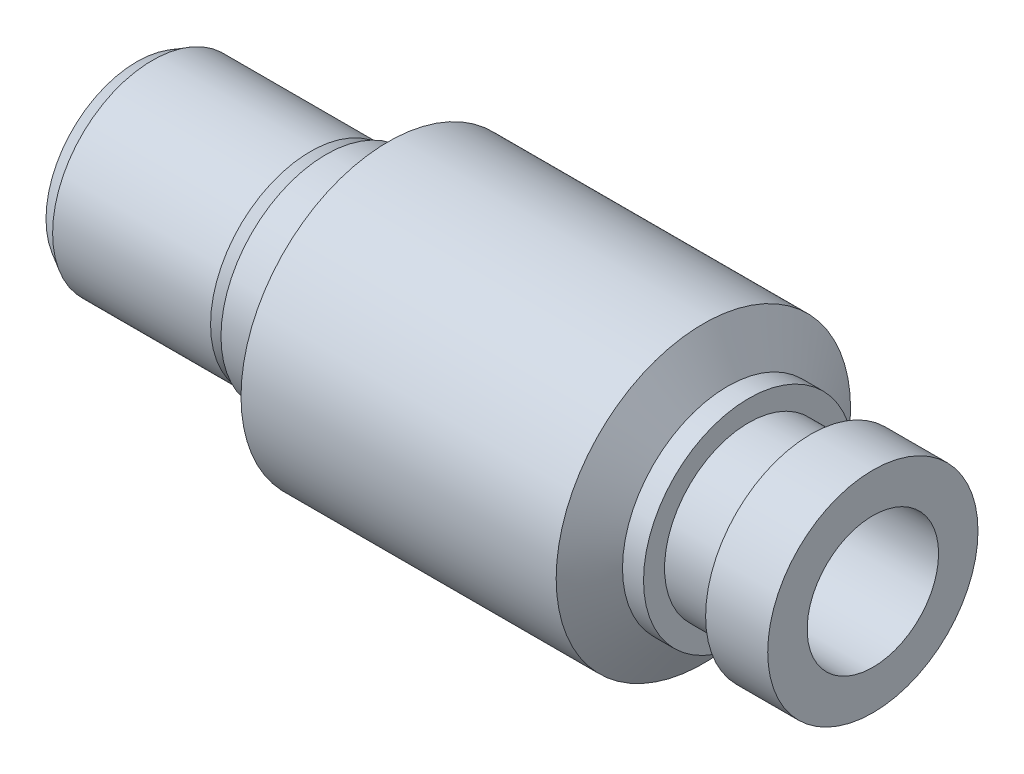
ISO-10303-21;
HEADER;
FILE_DESCRIPTION(('STEP AP214'),'2;1');
FILE_NAME('part.step','',(''),(''),'','','');
FILE_SCHEMA(('AUTOMOTIVE_DESIGN { 1 0 10303 214 1 1 1 1 }'));
ENDSEC;
DATA;
#1=APPLICATION_CONTEXT('core data for automotive mechanical design processes');
#2=APPLICATION_PROTOCOL_DEFINITION('international standard','automotive_design',2000,#1);
#3=PRODUCT_CONTEXT('',#1,'mechanical');
#4=PRODUCT('Part','Part','',(#3));
#5=PRODUCT_RELATED_PRODUCT_CATEGORY('part','',(#4));
#6=PRODUCT_DEFINITION_FORMATION('','',#4);
#7=PRODUCT_DEFINITION_CONTEXT('part definition',#1,'design');
#8=PRODUCT_DEFINITION('design','',#6,#7);
#9=PRODUCT_DEFINITION_SHAPE('','',#8);
#10=(LENGTH_UNIT() NAMED_UNIT(*) SI_UNIT(.MILLI.,.METRE.));
#11=(NAMED_UNIT(*) PLANE_ANGLE_UNIT() SI_UNIT($,.RADIAN.));
#12=(NAMED_UNIT(*) SI_UNIT($,.STERADIAN.) SOLID_ANGLE_UNIT());
#13=UNCERTAINTY_MEASURE_WITH_UNIT(LENGTH_MEASURE(1.E-05),#10,'distance_accuracy_value','');
#14=(GEOMETRIC_REPRESENTATION_CONTEXT(3) GLOBAL_UNCERTAINTY_ASSIGNED_CONTEXT((#13)) GLOBAL_UNIT_ASSIGNED_CONTEXT((#10,
#11,#12)) REPRESENTATION_CONTEXT('',''));
#15=CARTESIAN_POINT('',(0.,0.,0.));
#16=DIRECTION('',(0.,0.,1.));
#17=DIRECTION('',(1.,0.,0.));
#18=AXIS2_PLACEMENT_3D('',#15,#16,#17);
#19=CARTESIAN_POINT('',(0.,0.,0.));
#20=DIRECTION('',(-1.,0.,0.));
#21=DIRECTION('',(0.,0.,1.));
#22=AXIS2_PLACEMENT_3D('',#19,#20,#21);
#23=PLANE('',#22);
#24=CARTESIAN_POINT('',(0.,0.,0.));
#25=DIRECTION('',(1.,0.,0.));
#26=DIRECTION('',(0.,0.,-1.));
#27=AXIS2_PLACEMENT_3D('',#24,#25,#26);
#28=CIRCLE('',#27,2.19475835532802);
#29=CARTESIAN_POINT('',(0.,0.,-2.19475835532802));
#30=VERTEX_POINT('',#29);
#31=EDGE_CURVE('E136',#30,#30,#28,.T.);
#32=ORIENTED_EDGE('',*,*,#31,.F.);
#33=EDGE_LOOP('',(#32));
#34=FACE_BOUND('',#33,.T.);
#35=DIRECTION('',(0.,-0.866025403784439,0.5));
#36=VECTOR('',#35,1.);
#37=CARTESIAN_POINT('',(0.,1.016,0.58658787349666));
#38=LINE('',#37,#36);
#39=CARTESIAN_POINT('',(0.,1.016,0.58658787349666));
#40=VERTEX_POINT('',#39);
#41=CARTESIAN_POINT('',(0.,0.,1.17317574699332));
#42=VERTEX_POINT('',#41);
#43=EDGE_CURVE('E95',#40,#42,#38,.T.);
#44=ORIENTED_EDGE('',*,*,#43,.T.);
#45=DIRECTION('',(0.,-0.866025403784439,-0.5));
#46=VECTOR('',#45,1.);
#47=CARTESIAN_POINT('',(0.,0.,1.17317574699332));
#48=LINE('',#47,#46);
#49=CARTESIAN_POINT('',(0.,-1.016,0.58658787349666));
#50=VERTEX_POINT('',#49);
#51=EDGE_CURVE('E97',#42,#50,#48,.T.);
#52=ORIENTED_EDGE('',*,*,#51,.T.);
#53=DIRECTION('',(0.,0.,-1.));
#54=VECTOR('',#53,1.);
#55=CARTESIAN_POINT('',(0.,-1.016,0.58658787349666));
#56=LINE('',#55,#54);
#57=CARTESIAN_POINT('',(0.,-1.016,-0.58658787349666));
#58=VERTEX_POINT('',#57);
#59=EDGE_CURVE('E88',#50,#58,#56,.T.);
#60=ORIENTED_EDGE('',*,*,#59,.T.);
#61=DIRECTION('',(0.,0.866025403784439,-0.5));
#62=VECTOR('',#61,1.);
#63=CARTESIAN_POINT('',(0.,-1.016,-0.58658787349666));
#64=LINE('',#63,#62);
#65=CARTESIAN_POINT('',(0.,0.,-1.17317574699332));
#66=VERTEX_POINT('',#65);
#67=EDGE_CURVE('E32',#58,#66,#64,.T.);
#68=ORIENTED_EDGE('',*,*,#67,.T.);
#69=DIRECTION('',(0.,0.866025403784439,0.5));
#70=VECTOR('',#69,1.);
#71=CARTESIAN_POINT('',(0.,0.,-1.17317574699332));
#72=LINE('',#71,#70);
#73=CARTESIAN_POINT('',(0.,1.016,-0.58658787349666));
#74=VERTEX_POINT('',#73);
#75=EDGE_CURVE('E76',#66,#74,#72,.T.);
#76=ORIENTED_EDGE('',*,*,#75,.T.);
#77=DIRECTION('',(0.,0.,1.));
#78=VECTOR('',#77,1.);
#79=CARTESIAN_POINT('',(0.,1.016,-0.58658787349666));
#80=LINE('',#79,#78);
#81=EDGE_CURVE('E82',#74,#40,#80,.T.);
#82=ORIENTED_EDGE('',*,*,#81,.T.);
#83=EDGE_LOOP('',(#44,#52,#60,#68,#76,#82));
#84=FACE_BOUND('',#83,.T.);
#85=ADVANCED_FACE('F17',(#34,#84),#23,.T.);
#86=CARTESIAN_POINT('',(14.272,0.,0.));
#87=DIRECTION('',(-1.,0.,0.));
#88=DIRECTION('',(0.,0.,1.));
#89=AXIS2_PLACEMENT_3D('',#86,#87,#88);
#90=CONICAL_SURFACE('',#89,2.54,1.0471975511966);
#91=CARTESIAN_POINT('',(13.6854121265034,0.,0.));
#92=DIRECTION('',(1.,0.,0.));
#93=DIRECTION('',(0.,0.,-1.));
#94=AXIS2_PLACEMENT_3D('',#91,#92,#93);
#95=CIRCLE('',#94,3.556);
#96=CARTESIAN_POINT('',(13.6854121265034,0.,-3.556));
#97=VERTEX_POINT('',#96);
#98=EDGE_CURVE('E10',#97,#97,#95,.T.);
#99=ORIENTED_EDGE('',*,*,#98,.T.);
#100=EDGE_LOOP('',(#99));
#101=FACE_BOUND('',#100,.T.);
#102=CARTESIAN_POINT('',(14.272,0.,0.));
#103=DIRECTION('',(1.,0.,0.));
#104=DIRECTION('',(0.,0.,-1.));
#105=AXIS2_PLACEMENT_3D('',#102,#103,#104);
#106=CIRCLE('',#105,2.54);
#107=CARTESIAN_POINT('',(14.272,0.,-2.54));
#108=VERTEX_POINT('',#107);
#109=EDGE_CURVE('E111',#108,#108,#106,.T.);
#110=ORIENTED_EDGE('',*,*,#109,.F.);
#111=EDGE_LOOP('',(#110));
#112=FACE_BOUND('',#111,.T.);
#113=ADVANCED_FACE('F19',(#101,#112),#90,.T.);
#114=CARTESIAN_POINT('',(0.,0.,0.));
#115=DIRECTION('',(1.,0.,0.));
#116=DIRECTION('',(0.,0.,-1.));
#117=AXIS2_PLACEMENT_3D('',#114,#115,#116);
#118=CYLINDRICAL_SURFACE('',#117,3.556);
#119=CARTESIAN_POINT('',(6.072,0.,0.));
#120=DIRECTION('',(1.,0.,0.));
#121=DIRECTION('',(0.,0.,-1.));
#122=AXIS2_PLACEMENT_3D('',#119,#120,#121);
#123=CIRCLE('',#122,3.556);
#124=CARTESIAN_POINT('',(6.072,0.,-3.556));
#125=VERTEX_POINT('',#124);
#126=EDGE_CURVE('E25',#125,#125,#123,.T.);
#127=ORIENTED_EDGE('',*,*,#126,.T.);
#128=EDGE_LOOP('',(#127));
#129=FACE_BOUND('',#128,.T.);
#130=ORIENTED_EDGE('',*,*,#98,.F.);
#131=EDGE_LOOP('',(#130));
#132=FACE_BOUND('',#131,.T.);
#133=ADVANCED_FACE('F156',(#129,#132),#118,.T.);
#134=CARTESIAN_POINT('',(6.072,2.54,0.));
#135=DIRECTION('',(-1.,0.,0.));
#136=DIRECTION('',(0.,0.,1.));
#137=AXIS2_PLACEMENT_3D('',#134,#135,#136);
#138=PLANE('',#137);
#139=CARTESIAN_POINT('',(6.072,0.,0.));
#140=DIRECTION('',(1.,0.,0.));
#141=DIRECTION('',(0.,0.,-1.));
#142=AXIS2_PLACEMENT_3D('',#139,#140,#141);
#143=CIRCLE('',#142,2.54);
#144=CARTESIAN_POINT('',(6.072,0.,-2.54));
#145=VERTEX_POINT('',#144);
#146=EDGE_CURVE('E151',#145,#145,#143,.T.);
#147=ORIENTED_EDGE('',*,*,#146,.T.);
#148=EDGE_LOOP('',(#147));
#149=FACE_BOUND('',#148,.T.);
#150=ORIENTED_EDGE('',*,*,#126,.F.);
#151=EDGE_LOOP('',(#150));
#152=FACE_BOUND('',#151,.T.);
#153=ADVANCED_FACE('F159',(#149,#152),#138,.T.);
#154=CARTESIAN_POINT('',(0.,0.,0.));
#155=DIRECTION('',(1.,0.,0.));
#156=DIRECTION('',(0.,0.,-1.));
#157=AXIS2_PLACEMENT_3D('',#154,#155,#156);
#158=CYLINDRICAL_SURFACE('',#157,2.54);
#159=CARTESIAN_POINT('',(4.572,0.,0.));
#160=DIRECTION('',(1.,0.,0.));
#161=DIRECTION('',(0.,0.,-1.));
#162=AXIS2_PLACEMENT_3D('',#159,#160,#161);
#163=CIRCLE('',#162,2.54);
#164=CARTESIAN_POINT('',(4.572,0.,-2.54));
#165=VERTEX_POINT('',#164);
#166=EDGE_CURVE('E148',#165,#165,#163,.T.);
#167=ORIENTED_EDGE('',*,*,#166,.T.);
#168=EDGE_LOOP('',(#167));
#169=FACE_BOUND('',#168,.T.);
#170=ORIENTED_EDGE('',*,*,#146,.F.);
#171=EDGE_LOOP('',(#170));
#172=FACE_BOUND('',#171,.T.);
#173=ADVANCED_FACE('F161',(#169,#172),#158,.T.);
#174=CARTESIAN_POINT('',(4.572,2.19475835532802,0.));
#175=DIRECTION('',(-1.,0.,0.));
#176=DIRECTION('',(0.,0.,1.));
#177=AXIS2_PLACEMENT_3D('',#174,#175,#176);
#178=PLANE('',#177);
#179=CARTESIAN_POINT('',(4.572,0.,0.));
#180=DIRECTION('',(1.,0.,0.));
#181=DIRECTION('',(0.,0.,-1.));
#182=AXIS2_PLACEMENT_3D('',#179,#180,#181);
#183=CIRCLE('',#182,2.19475835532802);
#184=CARTESIAN_POINT('',(4.572,0.,-2.19475835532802));
#185=VERTEX_POINT('',#184);
#186=EDGE_CURVE('E145',#185,#185,#183,.T.);
#187=ORIENTED_EDGE('',*,*,#186,.T.);
#188=EDGE_LOOP('',(#187));
#189=FACE_BOUND('',#188,.T.);
#190=ORIENTED_EDGE('',*,*,#166,.F.);
#191=EDGE_LOOP('',(#190));
#192=FACE_BOUND('',#191,.T.);
#193=ADVANCED_FACE('F169',(#189,#192),#178,.T.);
#194=CARTESIAN_POINT('',(4.572,0.,0.));
#195=DIRECTION('',(-1.,0.,0.));
#196=DIRECTION('',(0.,0.,1.));
#197=AXIS2_PLACEMENT_3D('',#194,#195,#196);
#198=CONICAL_SURFACE('',#197,2.19475835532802,0.523598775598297);
#199=CARTESIAN_POINT('',(4.19399438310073,0.,0.));
#200=DIRECTION('',(1.,0.,0.));
#201=DIRECTION('',(0.,0.,-1.));
#202=AXIS2_PLACEMENT_3D('',#199,#200,#201);
#203=CIRCLE('',#202,2.413);
#204=CARTESIAN_POINT('',(4.19399438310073,0.,-2.413));
#205=VERTEX_POINT('',#204);
#206=EDGE_CURVE('E142',#205,#205,#203,.T.);
#207=ORIENTED_EDGE('',*,*,#206,.T.);
#208=EDGE_LOOP('',(#207));
#209=FACE_BOUND('',#208,.T.);
#210=ORIENTED_EDGE('',*,*,#186,.F.);
#211=EDGE_LOOP('',(#210));
#212=FACE_BOUND('',#211,.T.);
#213=ADVANCED_FACE('F191',(#209,#212),#198,.T.);
#214=CARTESIAN_POINT('',(0.,0.,0.));
#215=DIRECTION('',(1.,0.,0.));
#216=DIRECTION('',(0.,0.,-1.));
#217=AXIS2_PLACEMENT_3D('',#214,#215,#216);
#218=CYLINDRICAL_SURFACE('',#217,2.413);
#219=CARTESIAN_POINT('',(0.378005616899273,0.,0.));
#220=DIRECTION('',(1.,0.,0.));
#221=DIRECTION('',(0.,0.,-1.));
#222=AXIS2_PLACEMENT_3D('',#219,#220,#221);
#223=CIRCLE('',#222,2.413);
#224=CARTESIAN_POINT('',(0.378005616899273,0.,-2.413));
#225=VERTEX_POINT('',#224);
#226=EDGE_CURVE('E139',#225,#225,#223,.T.);
#227=ORIENTED_EDGE('',*,*,#226,.T.);
#228=EDGE_LOOP('',(#227));
#229=FACE_BOUND('',#228,.T.);
#230=ORIENTED_EDGE('',*,*,#206,.F.);
#231=EDGE_LOOP('',(#230));
#232=FACE_BOUND('',#231,.T.);
#233=ADVANCED_FACE('F187',(#229,#232),#218,.T.);
#234=CARTESIAN_POINT('',(0.378005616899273,0.,0.));
#235=DIRECTION('',(1.,0.,0.));
#236=DIRECTION('',(0.,0.,-1.));
#237=AXIS2_PLACEMENT_3D('',#234,#235,#236);
#238=CONICAL_SURFACE('',#237,2.413,0.523598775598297);
#239=ORIENTED_EDGE('',*,*,#31,.T.);
#240=EDGE_LOOP('',(#239));
#241=FACE_BOUND('',#240,.T.);
#242=ORIENTED_EDGE('',*,*,#226,.F.);
#243=EDGE_LOOP('',(#242));
#244=FACE_BOUND('',#243,.T.);
#245=ADVANCED_FACE('F184',(#241,#244),#238,.T.);
#246=CARTESIAN_POINT('',(6.604,1.5875,0.));
#247=DIRECTION('',(1.,0.,0.));
#248=DIRECTION('',(0.,0.,-1.));
#249=AXIS2_PLACEMENT_3D('',#246,#247,#248);
#250=PLANE('',#249);
#251=CARTESIAN_POINT('',(6.604,0.,0.));
#252=DIRECTION('',(1.,0.,0.));
#253=DIRECTION('',(0.,0.,-1.));
#254=AXIS2_PLACEMENT_3D('',#251,#252,#253);
#255=CIRCLE('',#254,0.816);
#256=CARTESIAN_POINT('',(6.604,0.,-0.816));
#257=VERTEX_POINT('',#256);
#258=EDGE_CURVE('E90',#257,#257,#255,.F.);
#259=ORIENTED_EDGE('',*,*,#258,.T.);
#260=EDGE_LOOP('',(#259));
#261=FACE_BOUND('',#260,.T.);
#262=CARTESIAN_POINT('',(6.604,0.,0.));
#263=DIRECTION('',(1.,0.,0.));
#264=DIRECTION('',(0.,0.,-1.));
#265=AXIS2_PLACEMENT_3D('',#262,#263,#264);
#266=CIRCLE('',#265,1.5875);
#267=CARTESIAN_POINT('',(6.604,0.,-1.5875));
#268=VERTEX_POINT('',#267);
#269=EDGE_CURVE('E133',#268,#268,#266,.T.);
#270=ORIENTED_EDGE('',*,*,#269,.T.);
#271=EDGE_LOOP('',(#270));
#272=FACE_BOUND('',#271,.T.);
#273=ADVANCED_FACE('F182',(#261,#272),#250,.T.);
#274=CARTESIAN_POINT('',(0.,0.,0.));
#275=DIRECTION('',(1.,0.,0.));
#276=DIRECTION('',(0.,0.,-1.));
#277=AXIS2_PLACEMENT_3D('',#274,#275,#276);
#278=CYLINDRICAL_SURFACE('',#277,1.5875);
#279=CARTESIAN_POINT('',(17.78,0.,0.));
#280=DIRECTION('',(1.,0.,0.));
#281=DIRECTION('',(0.,0.,-1.));
#282=AXIS2_PLACEMENT_3D('',#279,#280,#281);
#283=CIRCLE('',#282,1.5875);
#284=CARTESIAN_POINT('',(17.78,0.,-1.5875));
#285=VERTEX_POINT('',#284);
#286=EDGE_CURVE('E130',#285,#285,#283,.T.);
#287=ORIENTED_EDGE('',*,*,#286,.T.);
#288=EDGE_LOOP('',(#287));
#289=FACE_BOUND('',#288,.T.);
#290=ORIENTED_EDGE('',*,*,#269,.F.);
#291=EDGE_LOOP('',(#290));
#292=FACE_BOUND('',#291,.T.);
#293=ADVANCED_FACE('F232',(#289,#292),#278,.F.);
#294=CARTESIAN_POINT('',(17.78,2.54,0.));
#295=DIRECTION('',(1.,0.,0.));
#296=DIRECTION('',(0.,0.,-1.));
#297=AXIS2_PLACEMENT_3D('',#294,#295,#296);
#298=PLANE('',#297);
#299=CARTESIAN_POINT('',(17.78,0.,0.));
#300=DIRECTION('',(1.,0.,0.));
#301=DIRECTION('',(0.,0.,-1.));
#302=AXIS2_PLACEMENT_3D('',#299,#300,#301);
#303=CIRCLE('',#302,2.54);
#304=CARTESIAN_POINT('',(17.78,0.,-2.54));
#305=VERTEX_POINT('',#304);
#306=EDGE_CURVE('E127',#305,#305,#303,.T.);
#307=ORIENTED_EDGE('',*,*,#306,.T.);
#308=EDGE_LOOP('',(#307));
#309=FACE_BOUND('',#308,.T.);
#310=ORIENTED_EDGE('',*,*,#286,.F.);
#311=EDGE_LOOP('',(#310));
#312=FACE_BOUND('',#311,.T.);
#313=ADVANCED_FACE('F240',(#309,#312),#298,.T.);
#314=CARTESIAN_POINT('',(0.,0.,0.));
#315=DIRECTION('',(1.,0.,0.));
#316=DIRECTION('',(0.,0.,-1.));
#317=AXIS2_PLACEMENT_3D('',#314,#315,#316);
#318=CYLINDRICAL_SURFACE('',#317,2.54);
#319=CARTESIAN_POINT('',(16.28,0.,0.));
#320=DIRECTION('',(1.,0.,0.));
#321=DIRECTION('',(0.,0.,-1.));
#322=AXIS2_PLACEMENT_3D('',#319,#320,#321);
#323=CIRCLE('',#322,2.54);
#324=CARTESIAN_POINT('',(16.28,0.,-2.54));
#325=VERTEX_POINT('',#324);
#326=EDGE_CURVE('E124',#325,#325,#323,.T.);
#327=ORIENTED_EDGE('',*,*,#326,.T.);
#328=EDGE_LOOP('',(#327));
#329=FACE_BOUND('',#328,.T.);
#330=ORIENTED_EDGE('',*,*,#306,.F.);
#331=EDGE_LOOP('',(#330));
#332=FACE_BOUND('',#331,.T.);
#333=ADVANCED_FACE('F248',(#329,#332),#318,.T.);
#334=CARTESIAN_POINT('',(16.28,2.032,0.));
#335=DIRECTION('',(-1.,0.,0.));
#336=DIRECTION('',(0.,0.,1.));
#337=AXIS2_PLACEMENT_3D('',#334,#335,#336);
#338=PLANE('',#337);
#339=CARTESIAN_POINT('',(16.28,0.,0.));
#340=DIRECTION('',(1.,0.,0.));
#341=DIRECTION('',(0.,0.,-1.));
#342=AXIS2_PLACEMENT_3D('',#339,#340,#341);
#343=CIRCLE('',#342,2.032);
#344=CARTESIAN_POINT('',(16.28,0.,-2.032));
#345=VERTEX_POINT('',#344);
#346=EDGE_CURVE('E121',#345,#345,#343,.T.);
#347=ORIENTED_EDGE('',*,*,#346,.T.);
#348=EDGE_LOOP('',(#347));
#349=FACE_BOUND('',#348,.T.);
#350=ORIENTED_EDGE('',*,*,#326,.F.);
#351=EDGE_LOOP('',(#350));
#352=FACE_BOUND('',#351,.T.);
#353=ADVANCED_FACE('F257',(#349,#352),#338,.T.);
#354=CARTESIAN_POINT('',(0.,0.,0.));
#355=DIRECTION('',(1.,0.,0.));
#356=DIRECTION('',(0.,0.,-1.));
#357=AXIS2_PLACEMENT_3D('',#354,#355,#356);
#358=CYLINDRICAL_SURFACE('',#357,2.032);
#359=CARTESIAN_POINT('',(14.78,0.,0.));
#360=DIRECTION('',(1.,0.,0.));
#361=DIRECTION('',(0.,0.,-1.));
#362=AXIS2_PLACEMENT_3D('',#359,#360,#361);
#363=CIRCLE('',#362,2.032);
#364=CARTESIAN_POINT('',(14.78,0.,-2.032));
#365=VERTEX_POINT('',#364);
#366=EDGE_CURVE('E118',#365,#365,#363,.T.);
#367=ORIENTED_EDGE('',*,*,#366,.T.);
#368=EDGE_LOOP('',(#367));
#369=FACE_BOUND('',#368,.T.);
#370=ORIENTED_EDGE('',*,*,#346,.F.);
#371=EDGE_LOOP('',(#370));
#372=FACE_BOUND('',#371,.T.);
#373=ADVANCED_FACE('F266',(#369,#372),#358,.T.);
#374=CARTESIAN_POINT('',(14.78,2.54,0.));
#375=DIRECTION('',(1.,0.,0.));
#376=DIRECTION('',(0.,0.,-1.));
#377=AXIS2_PLACEMENT_3D('',#374,#375,#376);
#378=PLANE('',#377);
#379=CARTESIAN_POINT('',(14.78,0.,0.));
#380=DIRECTION('',(1.,0.,0.));
#381=DIRECTION('',(0.,0.,-1.));
#382=AXIS2_PLACEMENT_3D('',#379,#380,#381);
#383=CIRCLE('',#382,2.54);
#384=CARTESIAN_POINT('',(14.78,0.,-2.54));
#385=VERTEX_POINT('',#384);
#386=EDGE_CURVE('E114',#385,#385,#383,.T.);
#387=ORIENTED_EDGE('',*,*,#386,.T.);
#388=EDGE_LOOP('',(#387));
#389=FACE_BOUND('',#388,.T.);
#390=ORIENTED_EDGE('',*,*,#366,.F.);
#391=EDGE_LOOP('',(#390));
#392=FACE_BOUND('',#391,.T.);
#393=ADVANCED_FACE('F275',(#389,#392),#378,.T.);
#394=CARTESIAN_POINT('',(0.,0.,0.));
#395=DIRECTION('',(1.,0.,0.));
#396=DIRECTION('',(0.,0.,-1.));
#397=AXIS2_PLACEMENT_3D('',#394,#395,#396);
#398=CYLINDRICAL_SURFACE('',#397,2.54);
#399=ORIENTED_EDGE('',*,*,#109,.T.);
#400=EDGE_LOOP('',(#399));
#401=FACE_BOUND('',#400,.T.);
#402=ORIENTED_EDGE('',*,*,#386,.F.);
#403=EDGE_LOOP('',(#402));
#404=FACE_BOUND('',#403,.T.);
#405=ADVANCED_FACE('F284',(#401,#404),#398,.T.);
#406=CARTESIAN_POINT('',(7.10393127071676,0.,1.17317574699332));
#407=DIRECTION('',(0.,0.5,-0.866025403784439));
#408=DIRECTION('',(0.,0.866025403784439,0.5));
#409=AXIS2_PLACEMENT_3D('',#406,#407,#408);
#410=PLANE('',#409);
#411=DIRECTION('',(-1.,0.,0.));
#412=VECTOR('',#411,1.);
#413=CARTESIAN_POINT('',(7.10393127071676,-1.016,0.58658787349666));
#414=LINE('',#413,#412);
#415=CARTESIAN_POINT('',(2.,-1.016,0.58658787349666));
#416=VERTEX_POINT('',#415);
#417=EDGE_CURVE('E99',#416,#50,#414,.T.);
#418=ORIENTED_EDGE('',*,*,#417,.T.);
#419=ORIENTED_EDGE('',*,*,#51,.F.);
#420=DIRECTION('',(-1.,0.,0.));
#421=VECTOR('',#420,1.);
#422=CARTESIAN_POINT('',(7.10393127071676,0.,1.17317574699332));
#423=LINE('',#422,#421);
#424=CARTESIAN_POINT('',(2.,0.,1.17317574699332));
#425=VERTEX_POINT('',#424);
#426=EDGE_CURVE('E101',#425,#42,#423,.T.);
#427=ORIENTED_EDGE('',*,*,#426,.F.);
#428=DIRECTION('',(0.,0.866025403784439,0.5));
#429=VECTOR('',#428,1.);
#430=CARTESIAN_POINT('',(2.,0.,1.17317574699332));
#431=LINE('',#430,#429);
#432=EDGE_CURVE('E107',#416,#425,#431,.T.);
#433=ORIENTED_EDGE('',*,*,#432,.F.);
#434=EDGE_LOOP('',(#418,#419,#427,#433));
#435=FACE_BOUND('',#434,.T.);
#436=ADVANCED_FACE('F293',(#435),#410,.T.);
#437=CARTESIAN_POINT('',(7.10393127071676,1.016,0.58658787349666));
#438=DIRECTION('',(0.,-0.5,-0.866025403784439));
#439=DIRECTION('',(0.,0.866025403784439,-0.5));
#440=AXIS2_PLACEMENT_3D('',#437,#438,#439);
#441=PLANE('',#440);
#442=ORIENTED_EDGE('',*,*,#426,.T.);
#443=ORIENTED_EDGE('',*,*,#43,.F.);
#444=DIRECTION('',(-1.,0.,0.));
#445=VECTOR('',#444,1.);
#446=CARTESIAN_POINT('',(7.10393127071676,1.016,0.58658787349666));
#447=LINE('',#446,#445);
#448=CARTESIAN_POINT('',(2.,1.016,0.58658787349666));
#449=VERTEX_POINT('',#448);
#450=EDGE_CURVE('E103',#449,#40,#447,.T.);
#451=ORIENTED_EDGE('',*,*,#450,.F.);
#452=DIRECTION('',(0.,0.866025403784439,-0.5));
#453=VECTOR('',#452,1.);
#454=CARTESIAN_POINT('',(2.,1.016,0.58658787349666));
#455=LINE('',#454,#453);
#456=EDGE_CURVE('E110',#425,#449,#455,.T.);
#457=ORIENTED_EDGE('',*,*,#456,.F.);
#458=EDGE_LOOP('',(#442,#443,#451,#457));
#459=FACE_BOUND('',#458,.T.);
#460=ADVANCED_FACE('F302',(#459),#441,.T.);
#461=CARTESIAN_POINT('',(7.10393127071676,1.016,-0.58658787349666));
#462=DIRECTION('',(0.,-1.,0.));
#463=DIRECTION('',(0.,0.,-1.));
#464=AXIS2_PLACEMENT_3D('',#461,#462,#463);
#465=PLANE('',#464);
#466=ORIENTED_EDGE('',*,*,#450,.T.);
#467=ORIENTED_EDGE('',*,*,#81,.F.);
#468=DIRECTION('',(-1.,0.,0.));
#469=VECTOR('',#468,1.);
#470=CARTESIAN_POINT('',(7.10393127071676,1.016,-0.58658787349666));
#471=LINE('',#470,#469);
#472=CARTESIAN_POINT('',(2.,1.016,-0.58658787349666));
#473=VERTEX_POINT('',#472);
#474=EDGE_CURVE('E73',#473,#74,#471,.T.);
#475=ORIENTED_EDGE('',*,*,#474,.F.);
#476=DIRECTION('',(0.,0.,-1.));
#477=VECTOR('',#476,1.);
#478=CARTESIAN_POINT('',(2.,1.016,-0.58658787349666));
#479=LINE('',#478,#477);
#480=EDGE_CURVE('E425',#449,#473,#479,.T.);
#481=ORIENTED_EDGE('',*,*,#480,.F.);
#482=EDGE_LOOP('',(#466,#467,#475,#481));
#483=FACE_BOUND('',#482,.T.);
#484=ADVANCED_FACE('F311',(#483),#465,.T.);
#485=CARTESIAN_POINT('',(7.10393127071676,0.,-1.17317574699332));
#486=DIRECTION('',(0.,-0.5,0.866025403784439));
#487=DIRECTION('',(0.,-0.866025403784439,-0.5));
#488=AXIS2_PLACEMENT_3D('',#485,#486,#487);
#489=PLANE('',#488);
#490=ORIENTED_EDGE('',*,*,#474,.T.);
#491=ORIENTED_EDGE('',*,*,#75,.F.);
#492=DIRECTION('',(-1.,0.,0.));
#493=VECTOR('',#492,1.);
#494=CARTESIAN_POINT('',(7.10393127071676,0.,-1.17317574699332));
#495=LINE('',#494,#493);
#496=CARTESIAN_POINT('',(2.,0.,-1.17317574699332));
#497=VERTEX_POINT('',#496);
#498=EDGE_CURVE('E67',#497,#66,#495,.T.);
#499=ORIENTED_EDGE('',*,*,#498,.F.);
#500=DIRECTION('',(0.,-0.866025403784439,-0.5));
#501=VECTOR('',#500,1.);
#502=CARTESIAN_POINT('',(2.,0.,-1.17317574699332));
#503=LINE('',#502,#501);
#504=EDGE_CURVE('E428',#473,#497,#503,.T.);
#505=ORIENTED_EDGE('',*,*,#504,.F.);
#506=EDGE_LOOP('',(#490,#491,#499,#505));
#507=FACE_BOUND('',#506,.T.);
#508=ADVANCED_FACE('F77',(#507),#489,.T.);
#509=CARTESIAN_POINT('',(7.10393127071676,-1.016,-0.58658787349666));
#510=DIRECTION('',(0.,0.5,0.866025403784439));
#511=DIRECTION('',(0.,-0.866025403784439,0.5));
#512=AXIS2_PLACEMENT_3D('',#509,#510,#511);
#513=PLANE('',#512);
#514=ORIENTED_EDGE('',*,*,#498,.T.);
#515=ORIENTED_EDGE('',*,*,#67,.F.);
#516=DIRECTION('',(-1.,0.,0.));
#517=VECTOR('',#516,1.);
#518=CARTESIAN_POINT('',(7.10393127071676,-1.016,-0.58658787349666));
#519=LINE('',#518,#517);
#520=CARTESIAN_POINT('',(2.,-1.016,-0.58658787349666));
#521=VERTEX_POINT('',#520);
#522=EDGE_CURVE('E72',#521,#58,#519,.T.);
#523=ORIENTED_EDGE('',*,*,#522,.F.);
#524=DIRECTION('',(0.,-0.866025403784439,0.5));
#525=VECTOR('',#524,1.);
#526=CARTESIAN_POINT('',(2.,-1.016,-0.58658787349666));
#527=LINE('',#526,#525);
#528=EDGE_CURVE('E37',#497,#521,#527,.T.);
#529=ORIENTED_EDGE('',*,*,#528,.F.);
#530=EDGE_LOOP('',(#514,#515,#523,#529));
#531=FACE_BOUND('',#530,.T.);
#532=ADVANCED_FACE('F69',(#531),#513,.T.);
#533=CARTESIAN_POINT('',(7.10393127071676,-1.016,0.58658787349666));
#534=DIRECTION('',(0.,1.,0.));
#535=DIRECTION('',(0.,0.,1.));
#536=AXIS2_PLACEMENT_3D('',#533,#534,#535);
#537=PLANE('',#536);
#538=ORIENTED_EDGE('',*,*,#522,.T.);
#539=ORIENTED_EDGE('',*,*,#59,.F.);
#540=ORIENTED_EDGE('',*,*,#417,.F.);
#541=DIRECTION('',(0.,0.,1.));
#542=VECTOR('',#541,1.);
#543=CARTESIAN_POINT('',(2.,-1.016,0.58658787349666));
#544=LINE('',#543,#542);
#545=EDGE_CURVE('E115',#521,#416,#544,.T.);
#546=ORIENTED_EDGE('',*,*,#545,.F.);
#547=EDGE_LOOP('',(#538,#539,#540,#546));
#548=FACE_BOUND('',#547,.T.);
#549=ADVANCED_FACE('F335',(#548),#537,.T.);
#550=CARTESIAN_POINT('',(2.,0.,0.));
#551=DIRECTION('',(-1.,0.,0.));
#552=DIRECTION('',(0.,0.,1.));
#553=AXIS2_PLACEMENT_3D('',#550,#551,#552);
#554=PLANE('',#553);
#555=CARTESIAN_POINT('',(2.,0.,0.));
#556=DIRECTION('',(-1.,0.,0.));
#557=DIRECTION('',(0.,0.,1.));
#558=AXIS2_PLACEMENT_3D('',#555,#556,#557);
#559=CIRCLE('',#558,0.816);
#560=CARTESIAN_POINT('',(2.,0.,0.816));
#561=VERTEX_POINT('',#560);
#562=EDGE_CURVE('E417',#561,#561,#559,.T.);
#563=ORIENTED_EDGE('',*,*,#562,.F.);
#564=EDGE_LOOP('',(#563));
#565=FACE_BOUND('',#564,.T.);
#566=ORIENTED_EDGE('',*,*,#528,.T.);
#567=ORIENTED_EDGE('',*,*,#545,.T.);
#568=ORIENTED_EDGE('',*,*,#432,.T.);
#569=ORIENTED_EDGE('',*,*,#456,.T.);
#570=ORIENTED_EDGE('',*,*,#480,.T.);
#571=ORIENTED_EDGE('',*,*,#504,.T.);
#572=EDGE_LOOP('',(#566,#567,#568,#569,#570,#571));
#573=FACE_BOUND('',#572,.T.);
#574=ADVANCED_FACE('F343',(#565,#573),#554,.T.);
#575=CARTESIAN_POINT('',(8.91199653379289,0.,0.));
#576=DIRECTION('',(-1.,0.,0.));
#577=DIRECTION('',(0.,0.,1.));
#578=AXIS2_PLACEMENT_3D('',#575,#576,#577);
#579=CYLINDRICAL_SURFACE('',#578,0.816);
#580=ORIENTED_EDGE('',*,*,#562,.T.);
#581=EDGE_LOOP('',(#580));
#582=FACE_BOUND('',#581,.T.);
#583=ORIENTED_EDGE('',*,*,#258,.F.);
#584=EDGE_LOOP('',(#583));
#585=FACE_BOUND('',#584,.T.);
#586=ADVANCED_FACE('F352',(#582,#585),#579,.F.);
#587=CLOSED_SHELL('',(#85,#113,#133,#153,#173,#193,#213,#233,#245,#273,#293,#313,#333,#353,#373,
#393,#405,#436,#460,#484,#508,#532,#549,#574,#586));
#588=MANIFOLD_SOLID_BREP('B1',#587);
#589=ADVANCED_BREP_SHAPE_REPRESENTATION('',(#18,#588),#14);
#590=SHAPE_DEFINITION_REPRESENTATION(#9,#589);
ENDSEC;
END-ISO-10303-21;
